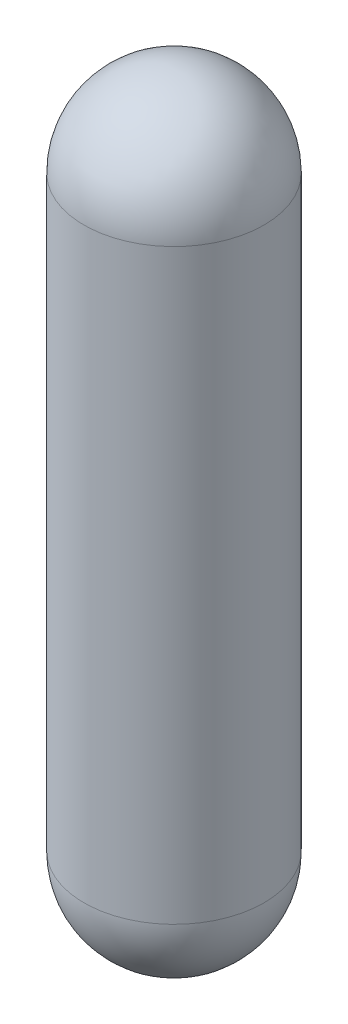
from build123d import *


with BuildPart() as part:
    # Sketch1 → Revolve1 (revolve)
    with BuildSketch(Plane.XY):
        with BuildLine():
            Line((0, 8.27), (0, -8.77))
            ThreePointArc((0, -8.77), (1.414213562, -8.184213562), (2, -6.77))
            Line((2, -6.77), (2, 6.27))
            ThreePointArc((2, 6.27), (1.414213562, 7.684213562), (0, 8.27))
        make_face()
    revolve(axis=Axis((0, 8.27, 0), (0, -1, 0)))


solid = part.part
